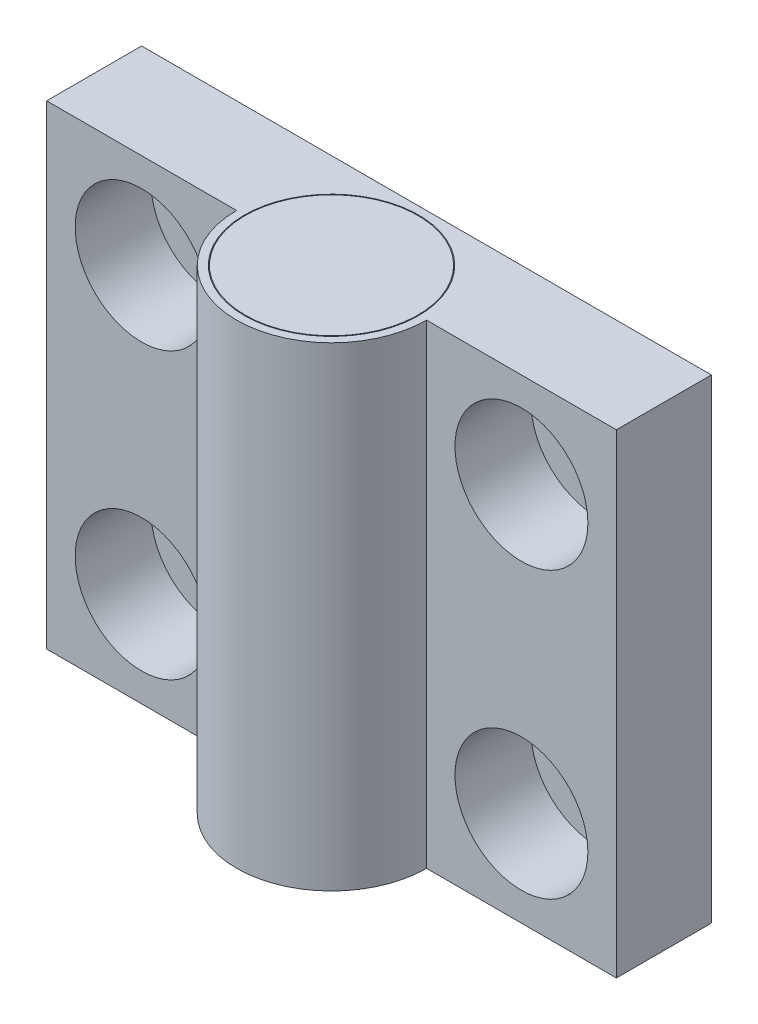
ISO-10303-21;
HEADER;
FILE_DESCRIPTION(('STEP AP214'),'2;1');
FILE_NAME('part.step','',(''),(''),'','','');
FILE_SCHEMA(('AUTOMOTIVE_DESIGN { 1 0 10303 214 1 1 1 1 }'));
ENDSEC;
DATA;
#1=APPLICATION_CONTEXT('core data for automotive mechanical design processes');
#2=APPLICATION_PROTOCOL_DEFINITION('international standard','automotive_design',2000,#1);
#3=PRODUCT_CONTEXT('',#1,'mechanical');
#4=PRODUCT('Part','Part','',(#3));
#5=PRODUCT_RELATED_PRODUCT_CATEGORY('part','',(#4));
#6=PRODUCT_DEFINITION_FORMATION('','',#4);
#7=PRODUCT_DEFINITION_CONTEXT('part definition',#1,'design');
#8=PRODUCT_DEFINITION('design','',#6,#7);
#9=PRODUCT_DEFINITION_SHAPE('','',#8);
#10=(LENGTH_UNIT() NAMED_UNIT(*) SI_UNIT(.MILLI.,.METRE.));
#11=(NAMED_UNIT(*) PLANE_ANGLE_UNIT() SI_UNIT($,.RADIAN.));
#12=(NAMED_UNIT(*) SI_UNIT($,.STERADIAN.) SOLID_ANGLE_UNIT());
#13=UNCERTAINTY_MEASURE_WITH_UNIT(LENGTH_MEASURE(1.E-05),#10,'distance_accuracy_value','');
#14=(GEOMETRIC_REPRESENTATION_CONTEXT(3) GLOBAL_UNCERTAINTY_ASSIGNED_CONTEXT((#13)) GLOBAL_UNIT_ASSIGNED_CONTEXT((#10,
#11,#12)) REPRESENTATION_CONTEXT('',''));
#15=CARTESIAN_POINT('',(0.,0.,0.));
#16=DIRECTION('',(0.,0.,1.));
#17=DIRECTION('',(1.,0.,0.));
#18=AXIS2_PLACEMENT_3D('',#15,#16,#17);
#19=CARTESIAN_POINT('',(-30.,25.,10.));
#20=DIRECTION('',(0.,-1.,0.));
#21=DIRECTION('',(0.,0.,-1.));
#22=AXIS2_PLACEMENT_3D('',#19,#20,#21);
#23=PLANE('',#22);
#24=CARTESIAN_POINT('',(0.,25.,10.));
#25=DIRECTION('',(0.,1.,0.));
#26=DIRECTION('',(0.,0.,1.));
#27=AXIS2_PLACEMENT_3D('',#24,#25,#26);
#28=CIRCLE('',#27,9.09269992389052);
#29=CARTESIAN_POINT('',(0.,25.,19.0926999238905));
#30=VERTEX_POINT('',#29);
#31=EDGE_CURVE('E20',#30,#30,#28,.F.);
#32=ORIENTED_EDGE('',*,*,#31,.F.);
#33=EDGE_LOOP('',(#32));
#34=FACE_BOUND('',#33,.T.);
#35=ADVANCED_FACE('F17',(#34),#23,.F.);
#36=CARTESIAN_POINT('',(-30.,-25.,10.));
#37=DIRECTION('',(0.,1.,0.));
#38=DIRECTION('',(0.,0.,1.));
#39=AXIS2_PLACEMENT_3D('',#36,#37,#38);
#40=PLANE('',#39);
#41=CARTESIAN_POINT('',(0.,-25.,10.));
#42=DIRECTION('',(0.,-1.,0.));
#43=DIRECTION('',(0.,0.,-1.));
#44=AXIS2_PLACEMENT_3D('',#41,#42,#43);
#45=CIRCLE('',#44,9.09269992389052);
#46=CARTESIAN_POINT('',(0.,-25.,0.907300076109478));
#47=VERTEX_POINT('',#46);
#48=EDGE_CURVE('E208',#47,#47,#45,.F.);
#49=ORIENTED_EDGE('',*,*,#48,.F.);
#50=EDGE_LOOP('',(#49));
#51=FACE_BOUND('',#50,.T.);
#52=ADVANCED_FACE('F218',(#51),#40,.F.);
#53=CARTESIAN_POINT('',(0.,24.,10.));
#54=DIRECTION('',(0.,1.,0.));
#55=DIRECTION('',(0.,0.,1.));
#56=AXIS2_PLACEMENT_3D('',#53,#54,#55);
#57=CYLINDRICAL_SURFACE('',#56,9.09269992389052);
#58=CARTESIAN_POINT('',(0.,24.,10.));
#59=DIRECTION('',(0.,1.,0.));
#60=DIRECTION('',(0.,0.,1.));
#61=AXIS2_PLACEMENT_3D('',#58,#59,#60);
#62=CIRCLE('',#61,9.09269992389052);
#63=CARTESIAN_POINT('',(0.,24.,19.0926999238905));
#64=VERTEX_POINT('',#63);
#65=EDGE_CURVE('E206',#64,#64,#62,.F.);
#66=ORIENTED_EDGE('',*,*,#65,.F.);
#67=EDGE_LOOP('',(#66));
#68=FACE_BOUND('',#67,.T.);
#69=ORIENTED_EDGE('',*,*,#31,.T.);
#70=EDGE_LOOP('',(#69));
#71=FACE_BOUND('',#70,.T.);
#72=ADVANCED_FACE('F215',(#68,#71),#57,.T.);
#73=CARTESIAN_POINT('',(0.,-24.,10.));
#74=DIRECTION('',(0.,-1.,0.));
#75=DIRECTION('',(0.,0.,-1.));
#76=AXIS2_PLACEMENT_3D('',#73,#74,#75);
#77=CYLINDRICAL_SURFACE('',#76,9.09269992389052);
#78=ORIENTED_EDGE('',*,*,#48,.T.);
#79=EDGE_LOOP('',(#78));
#80=FACE_BOUND('',#79,.T.);
#81=CARTESIAN_POINT('',(0.,-24.,10.));
#82=DIRECTION('',(0.,-1.,0.));
#83=DIRECTION('',(0.,0.,-1.));
#84=AXIS2_PLACEMENT_3D('',#81,#82,#83);
#85=CIRCLE('',#84,9.09269992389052);
#86=CARTESIAN_POINT('',(0.,-24.,0.907300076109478));
#87=VERTEX_POINT('',#86);
#88=EDGE_CURVE('E203',#87,#87,#85,.F.);
#89=ORIENTED_EDGE('',*,*,#88,.F.);
#90=EDGE_LOOP('',(#89));
#91=FACE_BOUND('',#90,.T.);
#92=ADVANCED_FACE('F316',(#80,#91),#77,.T.);
#93=CARTESIAN_POINT('',(0.,24.,10.));
#94=DIRECTION('',(0.,1.,0.));
#95=DIRECTION('',(0.,0.,1.));
#96=AXIS2_PLACEMENT_3D('',#93,#94,#95);
#97=PLANE('',#96);
#98=CARTESIAN_POINT('',(0.,24.,10.));
#99=DIRECTION('',(0.,1.,0.));
#100=DIRECTION('',(0.,0.,1.));
#101=AXIS2_PLACEMENT_3D('',#98,#99,#100);
#102=CIRCLE('',#101,9.17583073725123);
#103=CARTESIAN_POINT('',(0.,24.,19.1758307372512));
#104=VERTEX_POINT('',#103);
#105=EDGE_CURVE('E188',#104,#104,#102,.T.);
#106=ORIENTED_EDGE('',*,*,#105,.T.);
#107=EDGE_LOOP('',(#106));
#108=FACE_BOUND('',#107,.T.);
#109=ORIENTED_EDGE('',*,*,#65,.T.);
#110=EDGE_LOOP('',(#109));
#111=FACE_BOUND('',#110,.T.);
#112=ADVANCED_FACE('F312',(#108,#111),#97,.T.);
#113=CARTESIAN_POINT('',(-20.,-15.,2.));
#114=DIRECTION('',(0.,0.,1.));
#115=DIRECTION('',(1.,0.,0.));
#116=AXIS2_PLACEMENT_3D('',#113,#114,#115);
#117=CYLINDRICAL_SURFACE('',#116,7.);
#118=CARTESIAN_POINT('',(-20.,-15.,10.));
#119=DIRECTION('',(0.,0.,1.));
#120=DIRECTION('',(1.,0.,0.));
#121=AXIS2_PLACEMENT_3D('',#118,#119,#120);
#122=CIRCLE('',#121,7.);
#123=CARTESIAN_POINT('',(-13.,-15.,10.));
#124=VERTEX_POINT('',#123);
#125=EDGE_CURVE('E185',#124,#124,#122,.F.);
#126=ORIENTED_EDGE('',*,*,#125,.F.);
#127=EDGE_LOOP('',(#126));
#128=FACE_BOUND('',#127,.T.);
#129=CARTESIAN_POINT('',(-20.,-15.,2.));
#130=DIRECTION('',(0.,0.,1.));
#131=DIRECTION('',(1.,0.,0.));
#132=AXIS2_PLACEMENT_3D('',#129,#130,#131);
#133=CIRCLE('',#132,7.);
#134=CARTESIAN_POINT('',(-13.,-15.,2.));
#135=VERTEX_POINT('',#134);
#136=EDGE_CURVE('E200',#135,#135,#133,.T.);
#137=ORIENTED_EDGE('',*,*,#136,.F.);
#138=EDGE_LOOP('',(#137));
#139=FACE_BOUND('',#138,.T.);
#140=ADVANCED_FACE('F308',(#128,#139),#117,.F.);
#141=CARTESIAN_POINT('',(-20.,15.,2.));
#142=DIRECTION('',(0.,0.,1.));
#143=DIRECTION('',(1.,0.,0.));
#144=AXIS2_PLACEMENT_3D('',#141,#142,#143);
#145=CYLINDRICAL_SURFACE('',#144,7.);
#146=CARTESIAN_POINT('',(-20.,15.,10.));
#147=DIRECTION('',(0.,0.,1.));
#148=DIRECTION('',(1.,0.,0.));
#149=AXIS2_PLACEMENT_3D('',#146,#147,#148);
#150=CIRCLE('',#149,7.);
#151=CARTESIAN_POINT('',(-13.,15.,10.));
#152=VERTEX_POINT('',#151);
#153=EDGE_CURVE('E118',#152,#152,#150,.F.);
#154=ORIENTED_EDGE('',*,*,#153,.F.);
#155=EDGE_LOOP('',(#154));
#156=FACE_BOUND('',#155,.T.);
#157=CARTESIAN_POINT('',(-20.,15.,2.));
#158=DIRECTION('',(0.,0.,1.));
#159=DIRECTION('',(1.,0.,0.));
#160=AXIS2_PLACEMENT_3D('',#157,#158,#159);
#161=CIRCLE('',#160,7.);
#162=CARTESIAN_POINT('',(-13.,15.,2.));
#163=VERTEX_POINT('',#162);
#164=EDGE_CURVE('E191',#163,#163,#161,.T.);
#165=ORIENTED_EDGE('',*,*,#164,.F.);
#166=EDGE_LOOP('',(#165));
#167=FACE_BOUND('',#166,.T.);
#168=ADVANCED_FACE('F304',(#156,#167),#145,.F.);
#169=CARTESIAN_POINT('',(0.,-24.,10.));
#170=DIRECTION('',(0.,-1.,0.));
#171=DIRECTION('',(0.,0.,-1.));
#172=AXIS2_PLACEMENT_3D('',#169,#170,#171);
#173=PLANE('',#172);
#174=ORIENTED_EDGE('',*,*,#88,.T.);
#175=EDGE_LOOP('',(#174));
#176=FACE_BOUND('',#175,.T.);
#177=CARTESIAN_POINT('',(0.,-24.,10.));
#178=DIRECTION('',(0.,-1.,0.));
#179=DIRECTION('',(0.,0.,-1.));
#180=AXIS2_PLACEMENT_3D('',#177,#178,#179);
#181=CIRCLE('',#180,9.17583073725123);
#182=CARTESIAN_POINT('',(0.,-24.,0.824169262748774));
#183=VERTEX_POINT('',#182);
#184=EDGE_CURVE('E117',#183,#183,#181,.T.);
#185=ORIENTED_EDGE('',*,*,#184,.T.);
#186=EDGE_LOOP('',(#185));
#187=FACE_BOUND('',#186,.T.);
#188=ADVANCED_FACE('F300',(#176,#187),#173,.T.);
#189=CARTESIAN_POINT('',(20.,-15.,2.));
#190=DIRECTION('',(0.,0.,1.));
#191=DIRECTION('',(1.,0.,0.));
#192=AXIS2_PLACEMENT_3D('',#189,#190,#191);
#193=CYLINDRICAL_SURFACE('',#192,7.);
#194=CARTESIAN_POINT('',(20.,-15.,10.));
#195=DIRECTION('',(0.,0.,1.));
#196=DIRECTION('',(1.,0.,0.));
#197=AXIS2_PLACEMENT_3D('',#194,#195,#196);
#198=CIRCLE('',#197,7.);
#199=CARTESIAN_POINT('',(27.,-15.,10.));
#200=VERTEX_POINT('',#199);
#201=EDGE_CURVE('E178',#200,#200,#198,.F.);
#202=ORIENTED_EDGE('',*,*,#201,.F.);
#203=EDGE_LOOP('',(#202));
#204=FACE_BOUND('',#203,.T.);
#205=CARTESIAN_POINT('',(20.,-15.,2.));
#206=DIRECTION('',(0.,0.,1.));
#207=DIRECTION('',(1.,0.,0.));
#208=AXIS2_PLACEMENT_3D('',#205,#206,#207);
#209=CIRCLE('',#208,7.);
#210=CARTESIAN_POINT('',(27.,-15.,2.));
#211=VERTEX_POINT('',#210);
#212=EDGE_CURVE('E197',#211,#211,#209,.T.);
#213=ORIENTED_EDGE('',*,*,#212,.F.);
#214=EDGE_LOOP('',(#213));
#215=FACE_BOUND('',#214,.T.);
#216=ADVANCED_FACE('F296',(#204,#215),#193,.F.);
#217=CARTESIAN_POINT('',(20.,15.,2.));
#218=DIRECTION('',(0.,0.,1.));
#219=DIRECTION('',(1.,0.,0.));
#220=AXIS2_PLACEMENT_3D('',#217,#218,#219);
#221=CYLINDRICAL_SURFACE('',#220,7.);
#222=CARTESIAN_POINT('',(20.,15.,10.));
#223=DIRECTION('',(0.,0.,1.));
#224=DIRECTION('',(1.,0.,0.));
#225=AXIS2_PLACEMENT_3D('',#222,#223,#224);
#226=CIRCLE('',#225,7.);
#227=CARTESIAN_POINT('',(27.,15.,10.));
#228=VERTEX_POINT('',#227);
#229=EDGE_CURVE('E91',#228,#228,#226,.F.);
#230=ORIENTED_EDGE('',*,*,#229,.F.);
#231=EDGE_LOOP('',(#230));
#232=FACE_BOUND('',#231,.T.);
#233=CARTESIAN_POINT('',(20.,15.,2.));
#234=DIRECTION('',(0.,0.,1.));
#235=DIRECTION('',(1.,0.,0.));
#236=AXIS2_PLACEMENT_3D('',#233,#234,#235);
#237=CIRCLE('',#236,7.);
#238=CARTESIAN_POINT('',(27.,15.,2.));
#239=VERTEX_POINT('',#238);
#240=EDGE_CURVE('E194',#239,#239,#237,.T.);
#241=ORIENTED_EDGE('',*,*,#240,.F.);
#242=EDGE_LOOP('',(#241));
#243=FACE_BOUND('',#242,.T.);
#244=ADVANCED_FACE('F292',(#232,#243),#221,.F.);
#245=CARTESIAN_POINT('',(-20.,-15.,2.));
#246=DIRECTION('',(0.,0.,1.));
#247=DIRECTION('',(1.,0.,0.));
#248=AXIS2_PLACEMENT_3D('',#245,#246,#247);
#249=PLANE('',#248);
#250=CARTESIAN_POINT('',(-20.,-15.,2.));
#251=DIRECTION('',(0.,0.,1.));
#252=DIRECTION('',(1.,0.,0.));
#253=AXIS2_PLACEMENT_3D('',#250,#251,#252);
#254=CIRCLE('',#253,4.25);
#255=CARTESIAN_POINT('',(-15.75,-15.,2.));
#256=VERTEX_POINT('',#255);
#257=EDGE_CURVE('E90',#256,#256,#254,.F.);
#258=ORIENTED_EDGE('',*,*,#257,.T.);
#259=EDGE_LOOP('',(#258));
#260=FACE_BOUND('',#259,.T.);
#261=ORIENTED_EDGE('',*,*,#136,.T.);
#262=EDGE_LOOP('',(#261));
#263=FACE_BOUND('',#262,.T.);
#264=ADVANCED_FACE('F288',(#260,#263),#249,.T.);
#265=CARTESIAN_POINT('',(20.,-15.,2.));
#266=DIRECTION('',(0.,0.,1.));
#267=DIRECTION('',(1.,0.,0.));
#268=AXIS2_PLACEMENT_3D('',#265,#266,#267);
#269=PLANE('',#268);
#270=CARTESIAN_POINT('',(20.,-15.,2.));
#271=DIRECTION('',(0.,0.,1.));
#272=DIRECTION('',(1.,0.,0.));
#273=AXIS2_PLACEMENT_3D('',#270,#271,#272);
#274=CIRCLE('',#273,4.25);
#275=CARTESIAN_POINT('',(24.25,-15.,2.));
#276=VERTEX_POINT('',#275);
#277=EDGE_CURVE('E171',#276,#276,#274,.F.);
#278=ORIENTED_EDGE('',*,*,#277,.T.);
#279=EDGE_LOOP('',(#278));
#280=FACE_BOUND('',#279,.T.);
#281=ORIENTED_EDGE('',*,*,#212,.T.);
#282=EDGE_LOOP('',(#281));
#283=FACE_BOUND('',#282,.T.);
#284=ADVANCED_FACE('F284',(#280,#283),#269,.T.);
#285=CARTESIAN_POINT('',(20.,15.,2.));
#286=DIRECTION('',(0.,0.,1.));
#287=DIRECTION('',(1.,0.,0.));
#288=AXIS2_PLACEMENT_3D('',#285,#286,#287);
#289=PLANE('',#288);
#290=CARTESIAN_POINT('',(20.,15.,2.));
#291=DIRECTION('',(0.,0.,1.));
#292=DIRECTION('',(1.,0.,0.));
#293=AXIS2_PLACEMENT_3D('',#290,#291,#292);
#294=CIRCLE('',#293,4.25);
#295=CARTESIAN_POINT('',(24.25,15.,2.));
#296=VERTEX_POINT('',#295);
#297=EDGE_CURVE('E168',#296,#296,#294,.F.);
#298=ORIENTED_EDGE('',*,*,#297,.T.);
#299=EDGE_LOOP('',(#298));
#300=FACE_BOUND('',#299,.T.);
#301=ORIENTED_EDGE('',*,*,#240,.T.);
#302=EDGE_LOOP('',(#301));
#303=FACE_BOUND('',#302,.T.);
#304=ADVANCED_FACE('F280',(#300,#303),#289,.T.);
#305=CARTESIAN_POINT('',(-20.,15.,2.));
#306=DIRECTION('',(0.,0.,1.));
#307=DIRECTION('',(1.,0.,0.));
#308=AXIS2_PLACEMENT_3D('',#305,#306,#307);
#309=PLANE('',#308);
#310=CARTESIAN_POINT('',(-20.,15.,2.));
#311=DIRECTION('',(0.,0.,1.));
#312=DIRECTION('',(1.,0.,0.));
#313=AXIS2_PLACEMENT_3D('',#310,#311,#312);
#314=CIRCLE('',#313,4.25);
#315=CARTESIAN_POINT('',(-15.75,15.,2.));
#316=VERTEX_POINT('',#315);
#317=EDGE_CURVE('E100',#316,#316,#314,.F.);
#318=ORIENTED_EDGE('',*,*,#317,.T.);
#319=EDGE_LOOP('',(#318));
#320=FACE_BOUND('',#319,.T.);
#321=ORIENTED_EDGE('',*,*,#164,.T.);
#322=EDGE_LOOP('',(#321));
#323=FACE_BOUND('',#322,.T.);
#324=ADVANCED_FACE('F276',(#320,#323),#309,.T.);
#325=CARTESIAN_POINT('',(0.,24.,10.));
#326=DIRECTION('',(0.,1.,0.));
#327=DIRECTION('',(0.,0.,1.));
#328=AXIS2_PLACEMENT_3D('',#325,#326,#327);
#329=CYLINDRICAL_SURFACE('',#328,9.17583073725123);
#330=ORIENTED_EDGE('',*,*,#105,.F.);
#331=EDGE_LOOP('',(#330));
#332=FACE_BOUND('',#331,.T.);
#333=CARTESIAN_POINT('',(0.,25.,10.));
#334=DIRECTION('',(0.,1.,0.));
#335=DIRECTION('',(0.,0.,1.));
#336=AXIS2_PLACEMENT_3D('',#333,#334,#335);
#337=CIRCLE('',#336,9.17583073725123);
#338=CARTESIAN_POINT('',(0.,25.,19.1758307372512));
#339=VERTEX_POINT('',#338);
#340=EDGE_CURVE('E97',#339,#339,#337,.T.);
#341=ORIENTED_EDGE('',*,*,#340,.T.);
#342=EDGE_LOOP('',(#341));
#343=FACE_BOUND('',#342,.T.);
#344=ADVANCED_FACE('F273',(#332,#343),#329,.F.);
#345=CARTESIAN_POINT('',(0.,0.,10.));
#346=DIRECTION('',(0.,0.,1.));
#347=DIRECTION('',(1.,0.,0.));
#348=AXIS2_PLACEMENT_3D('',#345,#346,#347);
#349=PLANE('',#348);
#350=DIRECTION('',(0.,1.,0.));
#351=VECTOR('',#350,1.);
#352=CARTESIAN_POINT('',(-30.,25.,10.));
#353=LINE('',#352,#351);
#354=CARTESIAN_POINT('',(-30.,25.,10.));
#355=VERTEX_POINT('',#354);
#356=CARTESIAN_POINT('',(-30.,-25.,10.));
#357=VERTEX_POINT('',#356);
#358=EDGE_CURVE('E123',#355,#357,#353,.F.);
#359=ORIENTED_EDGE('',*,*,#358,.T.);
#360=DIRECTION('',(1.,0.,0.));
#361=VECTOR('',#360,1.);
#362=CARTESIAN_POINT('',(-30.,-25.,10.));
#363=LINE('',#362,#361);
#364=CARTESIAN_POINT('',(-10.,-25.,10.));
#365=VERTEX_POINT('',#364);
#366=EDGE_CURVE('E122',#357,#365,#363,.T.);
#367=ORIENTED_EDGE('',*,*,#366,.T.);
#368=DIRECTION('',(0.,1.,0.));
#369=VECTOR('',#368,1.);
#370=CARTESIAN_POINT('',(-10.,-53.2842712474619,10.));
#371=LINE('',#370,#369);
#372=CARTESIAN_POINT('',(-10.,25.,10.));
#373=VERTEX_POINT('',#372);
#374=EDGE_CURVE('E67',#373,#365,#371,.F.);
#375=ORIENTED_EDGE('',*,*,#374,.F.);
#376=DIRECTION('',(1.,0.,0.));
#377=VECTOR('',#376,1.);
#378=CARTESIAN_POINT('',(-30.,25.,10.));
#379=LINE('',#378,#377);
#380=EDGE_CURVE('E81',#373,#355,#379,.F.);
#381=ORIENTED_EDGE('',*,*,#380,.T.);
#382=EDGE_LOOP('',(#359,#367,#375,#381));
#383=FACE_BOUND('',#382,.T.);
#384=ORIENTED_EDGE('',*,*,#153,.T.);
#385=EDGE_LOOP('',(#384));
#386=FACE_BOUND('',#385,.T.);
#387=ORIENTED_EDGE('',*,*,#125,.T.);
#388=EDGE_LOOP('',(#387));
#389=FACE_BOUND('',#388,.T.);
#390=ADVANCED_FACE('F270',(#383,#386,#389),#349,.T.);
#391=CARTESIAN_POINT('',(0.,-53.2842712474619,10.));
#392=DIRECTION('',(0.,1.,0.));
#393=DIRECTION('',(0.,0.,1.));
#394=AXIS2_PLACEMENT_3D('',#391,#392,#393);
#395=CYLINDRICAL_SURFACE('',#394,10.);
#396=DIRECTION('',(0.,1.,0.));
#397=VECTOR('',#396,1.);
#398=CARTESIAN_POINT('',(9.99999999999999,0.,10.));
#399=LINE('',#398,#397);
#400=CARTESIAN_POINT('',(9.99999999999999,25.,10.));
#401=VERTEX_POINT('',#400);
#402=CARTESIAN_POINT('',(9.99999999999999,-25.,10.));
#403=VERTEX_POINT('',#402);
#404=EDGE_CURVE('E85',#401,#403,#399,.F.);
#405=ORIENTED_EDGE('',*,*,#404,.F.);
#406=CARTESIAN_POINT('',(0.,25.,10.));
#407=DIRECTION('',(0.,1.,0.));
#408=DIRECTION('',(0.,0.,1.));
#409=AXIS2_PLACEMENT_3D('',#406,#407,#408);
#410=CIRCLE('',#409,10.);
#411=EDGE_CURVE('E72',#401,#373,#410,.F.);
#412=ORIENTED_EDGE('',*,*,#411,.T.);
#413=ORIENTED_EDGE('',*,*,#374,.T.);
#414=CARTESIAN_POINT('',(0.,-25.,10.));
#415=DIRECTION('',(0.,1.,0.));
#416=DIRECTION('',(0.,0.,1.));
#417=AXIS2_PLACEMENT_3D('',#414,#415,#416);
#418=CIRCLE('',#417,10.);
#419=EDGE_CURVE('E87',#365,#403,#418,.T.);
#420=ORIENTED_EDGE('',*,*,#419,.T.);
#421=EDGE_LOOP('',(#405,#412,#413,#420));
#422=FACE_BOUND('',#421,.T.);
#423=ADVANCED_FACE('F86',(#422),#395,.T.);
#424=CARTESIAN_POINT('',(0.,-24.,10.));
#425=DIRECTION('',(0.,-1.,0.));
#426=DIRECTION('',(0.,0.,-1.));
#427=AXIS2_PLACEMENT_3D('',#424,#425,#426);
#428=CYLINDRICAL_SURFACE('',#427,9.17583073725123);
#429=CARTESIAN_POINT('',(0.,-25.,10.));
#430=DIRECTION('',(0.,-1.,0.));
#431=DIRECTION('',(0.,0.,-1.));
#432=AXIS2_PLACEMENT_3D('',#429,#430,#431);
#433=CIRCLE('',#432,9.17583073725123);
#434=CARTESIAN_POINT('',(0.,-25.,0.824169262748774));
#435=VERTEX_POINT('',#434);
#436=EDGE_CURVE('E113',#435,#435,#433,.T.);
#437=ORIENTED_EDGE('',*,*,#436,.T.);
#438=EDGE_LOOP('',(#437));
#439=FACE_BOUND('',#438,.T.);
#440=ORIENTED_EDGE('',*,*,#184,.F.);
#441=EDGE_LOOP('',(#440));
#442=FACE_BOUND('',#441,.T.);
#443=ADVANCED_FACE('F264',(#439,#442),#428,.F.);
#444=CARTESIAN_POINT('',(0.,0.,10.));
#445=DIRECTION('',(0.,0.,1.));
#446=DIRECTION('',(1.,0.,0.));
#447=AXIS2_PLACEMENT_3D('',#444,#445,#446);
#448=PLANE('',#447);
#449=DIRECTION('',(0.,-1.,0.));
#450=VECTOR('',#449,1.);
#451=CARTESIAN_POINT('',(30.,25.,10.));
#452=LINE('',#451,#450);
#453=CARTESIAN_POINT('',(30.,-25.,10.));
#454=VERTEX_POINT('',#453);
#455=CARTESIAN_POINT('',(30.,25.,10.));
#456=VERTEX_POINT('',#455);
#457=EDGE_CURVE('E96',#454,#456,#452,.F.);
#458=ORIENTED_EDGE('',*,*,#457,.T.);
#459=DIRECTION('',(1.,0.,0.));
#460=VECTOR('',#459,1.);
#461=CARTESIAN_POINT('',(-30.,25.,10.));
#462=LINE('',#461,#460);
#463=EDGE_CURVE('E78',#456,#401,#462,.F.);
#464=ORIENTED_EDGE('',*,*,#463,.T.);
#465=ORIENTED_EDGE('',*,*,#404,.T.);
#466=DIRECTION('',(1.,0.,0.));
#467=VECTOR('',#466,1.);
#468=CARTESIAN_POINT('',(-30.,-25.,10.));
#469=LINE('',#468,#467);
#470=EDGE_CURVE('E164',#403,#454,#469,.T.);
#471=ORIENTED_EDGE('',*,*,#470,.T.);
#472=EDGE_LOOP('',(#458,#464,#465,#471));
#473=FACE_BOUND('',#472,.T.);
#474=ORIENTED_EDGE('',*,*,#229,.T.);
#475=EDGE_LOOP('',(#474));
#476=FACE_BOUND('',#475,.T.);
#477=ORIENTED_EDGE('',*,*,#201,.T.);
#478=EDGE_LOOP('',(#477));
#479=FACE_BOUND('',#478,.T.);
#480=ADVANCED_FACE('F94',(#473,#476,#479),#448,.T.);
#481=CARTESIAN_POINT('',(-20.,-15.,0.));
#482=DIRECTION('',(0.,0.,1.));
#483=DIRECTION('',(1.,0.,0.));
#484=AXIS2_PLACEMENT_3D('',#481,#482,#483);
#485=CYLINDRICAL_SURFACE('',#484,4.25);
#486=CARTESIAN_POINT('',(-20.,-15.,0.));
#487=DIRECTION('',(0.,0.,1.));
#488=DIRECTION('',(1.,0.,0.));
#489=AXIS2_PLACEMENT_3D('',#486,#487,#488);
#490=CIRCLE('',#489,4.25);
#491=CARTESIAN_POINT('',(-15.75,-15.,0.));
#492=VERTEX_POINT('',#491);
#493=EDGE_CURVE('E149',#492,#492,#490,.F.);
#494=ORIENTED_EDGE('',*,*,#493,.T.);
#495=EDGE_LOOP('',(#494));
#496=FACE_BOUND('',#495,.T.);
#497=ORIENTED_EDGE('',*,*,#257,.F.);
#498=EDGE_LOOP('',(#497));
#499=FACE_BOUND('',#498,.T.);
#500=ADVANCED_FACE('F257',(#496,#499),#485,.F.);
#501=CARTESIAN_POINT('',(20.,-15.,0.));
#502=DIRECTION('',(0.,0.,1.));
#503=DIRECTION('',(1.,0.,0.));
#504=AXIS2_PLACEMENT_3D('',#501,#502,#503);
#505=CYLINDRICAL_SURFACE('',#504,4.25);
#506=CARTESIAN_POINT('',(20.,-15.,0.));
#507=DIRECTION('',(0.,0.,1.));
#508=DIRECTION('',(1.,0.,0.));
#509=AXIS2_PLACEMENT_3D('',#506,#507,#508);
#510=CIRCLE('',#509,4.25);
#511=CARTESIAN_POINT('',(24.25,-15.,0.));
#512=VERTEX_POINT('',#511);
#513=EDGE_CURVE('E157',#512,#512,#510,.F.);
#514=ORIENTED_EDGE('',*,*,#513,.T.);
#515=EDGE_LOOP('',(#514));
#516=FACE_BOUND('',#515,.T.);
#517=ORIENTED_EDGE('',*,*,#277,.F.);
#518=EDGE_LOOP('',(#517));
#519=FACE_BOUND('',#518,.T.);
#520=ADVANCED_FACE('F253',(#516,#519),#505,.F.);
#521=CARTESIAN_POINT('',(20.,15.,0.));
#522=DIRECTION('',(0.,0.,1.));
#523=DIRECTION('',(1.,0.,0.));
#524=AXIS2_PLACEMENT_3D('',#521,#522,#523);
#525=CYLINDRICAL_SURFACE('',#524,4.25);
#526=CARTESIAN_POINT('',(20.,15.,0.));
#527=DIRECTION('',(0.,0.,1.));
#528=DIRECTION('',(1.,0.,0.));
#529=AXIS2_PLACEMENT_3D('',#526,#527,#528);
#530=CIRCLE('',#529,4.25);
#531=CARTESIAN_POINT('',(24.25,15.,0.));
#532=VERTEX_POINT('',#531);
#533=EDGE_CURVE('E154',#532,#532,#530,.F.);
#534=ORIENTED_EDGE('',*,*,#533,.T.);
#535=EDGE_LOOP('',(#534));
#536=FACE_BOUND('',#535,.T.);
#537=ORIENTED_EDGE('',*,*,#297,.F.);
#538=EDGE_LOOP('',(#537));
#539=FACE_BOUND('',#538,.T.);
#540=ADVANCED_FACE('F249',(#536,#539),#525,.F.);
#541=CARTESIAN_POINT('',(-20.,15.,0.));
#542=DIRECTION('',(0.,0.,1.));
#543=DIRECTION('',(1.,0.,0.));
#544=AXIS2_PLACEMENT_3D('',#541,#542,#543);
#545=CYLINDRICAL_SURFACE('',#544,4.25);
#546=CARTESIAN_POINT('',(-20.,15.,0.));
#547=DIRECTION('',(0.,0.,1.));
#548=DIRECTION('',(1.,0.,0.));
#549=AXIS2_PLACEMENT_3D('',#546,#547,#548);
#550=CIRCLE('',#549,4.25);
#551=CARTESIAN_POINT('',(-15.75,15.,0.));
#552=VERTEX_POINT('',#551);
#553=EDGE_CURVE('E145',#552,#552,#550,.F.);
#554=ORIENTED_EDGE('',*,*,#553,.T.);
#555=EDGE_LOOP('',(#554));
#556=FACE_BOUND('',#555,.T.);
#557=ORIENTED_EDGE('',*,*,#317,.F.);
#558=EDGE_LOOP('',(#557));
#559=FACE_BOUND('',#558,.T.);
#560=ADVANCED_FACE('F246',(#556,#559),#545,.F.);
#561=CARTESIAN_POINT('',(-30.,25.,10.));
#562=DIRECTION('',(0.,-1.,0.));
#563=DIRECTION('',(0.,0.,-1.));
#564=AXIS2_PLACEMENT_3D('',#561,#562,#563);
#565=PLANE('',#564);
#566=ORIENTED_EDGE('',*,*,#411,.F.);
#567=ORIENTED_EDGE('',*,*,#463,.F.);
#568=DIRECTION('',(0.,0.,1.));
#569=VECTOR('',#568,1.);
#570=CARTESIAN_POINT('',(30.,25.,10.));
#571=LINE('',#570,#569);
#572=CARTESIAN_POINT('',(30.,25.,0.));
#573=VERTEX_POINT('',#572);
#574=EDGE_CURVE('E109',#456,#573,#571,.F.);
#575=ORIENTED_EDGE('',*,*,#574,.T.);
#576=DIRECTION('',(1.,0.,0.));
#577=VECTOR('',#576,1.);
#578=CARTESIAN_POINT('',(0.,25.,0.));
#579=LINE('',#578,#577);
#580=CARTESIAN_POINT('',(-30.,25.,0.));
#581=VERTEX_POINT('',#580);
#582=EDGE_CURVE('E137',#573,#581,#579,.F.);
#583=ORIENTED_EDGE('',*,*,#582,.T.);
#584=DIRECTION('',(0.,0.,1.));
#585=VECTOR('',#584,1.);
#586=CARTESIAN_POINT('',(-30.,25.,10.));
#587=LINE('',#586,#585);
#588=EDGE_CURVE('E127',#581,#355,#587,.T.);
#589=ORIENTED_EDGE('',*,*,#588,.T.);
#590=ORIENTED_EDGE('',*,*,#380,.F.);
#591=EDGE_LOOP('',(#566,#567,#575,#583,#589,#590));
#592=FACE_BOUND('',#591,.T.);
#593=ORIENTED_EDGE('',*,*,#340,.F.);
#594=EDGE_LOOP('',(#593));
#595=FACE_BOUND('',#594,.T.);
#596=ADVANCED_FACE('F74',(#592,#595),#565,.F.);
#597=CARTESIAN_POINT('',(-30.,25.,10.));
#598=DIRECTION('',(1.,0.,0.));
#599=DIRECTION('',(0.,1.,0.));
#600=AXIS2_PLACEMENT_3D('',#597,#598,#599);
#601=PLANE('',#600);
#602=DIRECTION('',(0.,0.,1.));
#603=VECTOR('',#602,1.);
#604=CARTESIAN_POINT('',(-30.,-25.,10.));
#605=LINE('',#604,#603);
#606=CARTESIAN_POINT('',(-30.,-25.,0.));
#607=VERTEX_POINT('',#606);
#608=EDGE_CURVE('E119',#607,#357,#605,.T.);
#609=ORIENTED_EDGE('',*,*,#608,.T.);
#610=ORIENTED_EDGE('',*,*,#358,.F.);
#611=ORIENTED_EDGE('',*,*,#588,.F.);
#612=DIRECTION('',(0.,1.,0.));
#613=VECTOR('',#612,1.);
#614=CARTESIAN_POINT('',(-30.,0.,0.));
#615=LINE('',#614,#613);
#616=EDGE_CURVE('E132',#581,#607,#615,.F.);
#617=ORIENTED_EDGE('',*,*,#616,.T.);
#618=EDGE_LOOP('',(#609,#610,#611,#617));
#619=FACE_BOUND('',#618,.T.);
#620=ADVANCED_FACE('F239',(#619),#601,.F.);
#621=CARTESIAN_POINT('',(-30.,-25.,10.));
#622=DIRECTION('',(0.,1.,0.));
#623=DIRECTION('',(0.,0.,1.));
#624=AXIS2_PLACEMENT_3D('',#621,#622,#623);
#625=PLANE('',#624);
#626=ORIENTED_EDGE('',*,*,#436,.F.);
#627=EDGE_LOOP('',(#626));
#628=FACE_BOUND('',#627,.T.);
#629=DIRECTION('',(0.,0.,1.));
#630=VECTOR('',#629,1.);
#631=CARTESIAN_POINT('',(30.,-25.,10.));
#632=LINE('',#631,#630);
#633=CARTESIAN_POINT('',(30.,-25.,0.));
#634=VERTEX_POINT('',#633);
#635=EDGE_CURVE('E34',#634,#454,#632,.T.);
#636=ORIENTED_EDGE('',*,*,#635,.T.);
#637=ORIENTED_EDGE('',*,*,#470,.F.);
#638=ORIENTED_EDGE('',*,*,#419,.F.);
#639=ORIENTED_EDGE('',*,*,#366,.F.);
#640=ORIENTED_EDGE('',*,*,#608,.F.);
#641=DIRECTION('',(1.,0.,0.));
#642=VECTOR('',#641,1.);
#643=CARTESIAN_POINT('',(0.,-25.,0.));
#644=LINE('',#643,#642);
#645=EDGE_CURVE('E26',#607,#634,#644,.T.);
#646=ORIENTED_EDGE('',*,*,#645,.T.);
#647=EDGE_LOOP('',(#636,#637,#638,#639,#640,#646));
#648=FACE_BOUND('',#647,.T.);
#649=ADVANCED_FACE('F232',(#628,#648),#625,.F.);
#650=CARTESIAN_POINT('',(30.,25.,10.));
#651=DIRECTION('',(-1.,0.,0.));
#652=DIRECTION('',(0.,-1.,0.));
#653=AXIS2_PLACEMENT_3D('',#650,#651,#652);
#654=PLANE('',#653);
#655=ORIENTED_EDGE('',*,*,#574,.F.);
#656=ORIENTED_EDGE('',*,*,#457,.F.);
#657=ORIENTED_EDGE('',*,*,#635,.F.);
#658=DIRECTION('',(0.,1.,0.));
#659=VECTOR('',#658,1.);
#660=CARTESIAN_POINT('',(30.,0.,0.));
#661=LINE('',#660,#659);
#662=EDGE_CURVE('E11',#634,#573,#661,.T.);
#663=ORIENTED_EDGE('',*,*,#662,.T.);
#664=EDGE_LOOP('',(#655,#656,#657,#663));
#665=FACE_BOUND('',#664,.T.);
#666=ADVANCED_FACE('F226',(#665),#654,.F.);
#667=CARTESIAN_POINT('',(0.,0.,0.));
#668=DIRECTION('',(0.,0.,1.));
#669=DIRECTION('',(1.,0.,0.));
#670=AXIS2_PLACEMENT_3D('',#667,#668,#669);
#671=PLANE('',#670);
#672=ORIENTED_EDGE('',*,*,#645,.F.);
#673=ORIENTED_EDGE('',*,*,#616,.F.);
#674=ORIENTED_EDGE('',*,*,#582,.F.);
#675=ORIENTED_EDGE('',*,*,#662,.F.);
#676=EDGE_LOOP('',(#672,#673,#674,#675));
#677=FACE_BOUND('',#676,.T.);
#678=ORIENTED_EDGE('',*,*,#553,.F.);
#679=EDGE_LOOP('',(#678));
#680=FACE_BOUND('',#679,.T.);
#681=ORIENTED_EDGE('',*,*,#533,.F.);
#682=EDGE_LOOP('',(#681));
#683=FACE_BOUND('',#682,.T.);
#684=ORIENTED_EDGE('',*,*,#513,.F.);
#685=EDGE_LOOP('',(#684));
#686=FACE_BOUND('',#685,.T.);
#687=ORIENTED_EDGE('',*,*,#493,.F.);
#688=EDGE_LOOP('',(#687));
#689=FACE_BOUND('',#688,.T.);
#690=ADVANCED_FACE('F224',(#677,#680,#683,#686,#689),#671,.F.);
#691=CLOSED_SHELL('',(#35,#52,#72,#92,#112,#140,#168,#188,#216,#244,#264,#284,#304,#324,#344,
#390,#423,#443,#480,#500,#520,#540,#560,#596,#620,#649,#666,#690));
#692=MANIFOLD_SOLID_BREP('B1',#691);
#693=ADVANCED_BREP_SHAPE_REPRESENTATION('',(#18,#692),#14);
#694=SHAPE_DEFINITION_REPRESENTATION(#9,#693);
ENDSEC;
END-ISO-10303-21;
